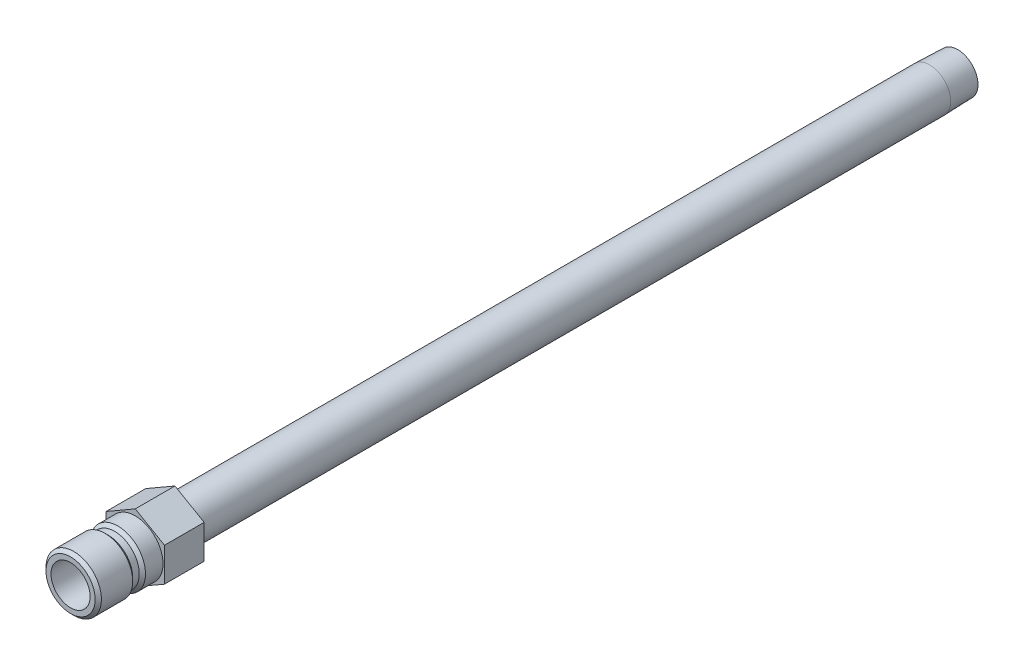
from build123d import *

# Parameters (mm, degrees)
SKETCH2_R           = 4.7625
BOSS_EXTRUDE1_DEPTH = 9.652


with BuildPart() as part:
    # Sketch1 → Revolve1 (revolve)
    with BuildSketch(Plane(origin=(0, 0, 0), x_dir=(0, 0, -1), z_dir=(1, 0, 0))):
        Polygon((-15.748, 4.7625), (-15.748, 5.9817), (-14.986, 6.7437), (-7.366, 6.7437), (-6.604, 5.9817), (-5.0165, 5.9817), (-4.2545, 6.7437), (9.652, 6.7437), (9.652, 5.1435), (193.294, 5.1435), (200.152, 4.929188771), (200.152, 3.4163), (-2.840212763, 3.4163), (-3.556, 4.7625), align=None)
    revolve(axis=Axis((0, 0, -9.652), (0, 0, 1)))

    # Sketch2 → Boss-Extrude1 (add)
    with BuildSketch(Plane.XY):
        Polygon((-7.112, 4.106115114), (-7.112, -4.106115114), (0, -8.212230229), (7.112, -4.106115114), (7.112, 4.106115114), (0, 8.212230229), align=None)
        with Locations(Location((0, 0, 0), (0, 0, 90))):
            Circle(SKETCH2_R, mode=Mode.SUBTRACT)
    extrude(amount=-BOSS_EXTRUDE1_DEPTH)


solid = part.part
